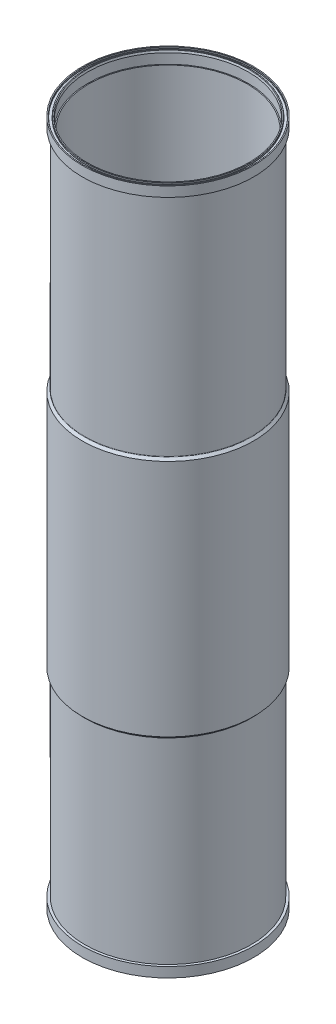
ISO-10303-21;
HEADER;
FILE_DESCRIPTION(('STEP AP214'),'2;1');
FILE_NAME('part.step','',(''),(''),'','','');
FILE_SCHEMA(('AUTOMOTIVE_DESIGN { 1 0 10303 214 1 1 1 1 }'));
ENDSEC;
DATA;
#1=APPLICATION_CONTEXT('core data for automotive mechanical design processes');
#2=APPLICATION_PROTOCOL_DEFINITION('international standard','automotive_design',2000,#1);
#3=PRODUCT_CONTEXT('',#1,'mechanical');
#4=PRODUCT('Part','Part','',(#3));
#5=PRODUCT_RELATED_PRODUCT_CATEGORY('part','',(#4));
#6=PRODUCT_DEFINITION_FORMATION('','',#4);
#7=PRODUCT_DEFINITION_CONTEXT('part definition',#1,'design');
#8=PRODUCT_DEFINITION('design','',#6,#7);
#9=PRODUCT_DEFINITION_SHAPE('','',#8);
#10=(LENGTH_UNIT() NAMED_UNIT(*) SI_UNIT(.MILLI.,.METRE.));
#11=(NAMED_UNIT(*) PLANE_ANGLE_UNIT() SI_UNIT($,.RADIAN.));
#12=(NAMED_UNIT(*) SI_UNIT($,.STERADIAN.) SOLID_ANGLE_UNIT());
#13=UNCERTAINTY_MEASURE_WITH_UNIT(LENGTH_MEASURE(1.E-05),#10,'distance_accuracy_value','');
#14=(GEOMETRIC_REPRESENTATION_CONTEXT(3) GLOBAL_UNCERTAINTY_ASSIGNED_CONTEXT((#13)) GLOBAL_UNIT_ASSIGNED_CONTEXT((#10,
#11,#12)) REPRESENTATION_CONTEXT('',''));
#15=CARTESIAN_POINT('',(0.,0.,0.));
#16=DIRECTION('',(0.,0.,1.));
#17=DIRECTION('',(1.,0.,0.));
#18=AXIS2_PLACEMENT_3D('',#15,#16,#17);
#19=CARTESIAN_POINT('',(0.,880.11,0.));
#20=DIRECTION('',(0.,1.,0.));
#21=DIRECTION('',(0.,0.,1.));
#22=AXIS2_PLACEMENT_3D('',#19,#20,#21);
#23=CYLINDRICAL_SURFACE('',#22,106.4387);
#24=CARTESIAN_POINT('',(0.,863.6,0.));
#25=DIRECTION('',(0.,1.,0.));
#26=DIRECTION('',(0.,0.,1.));
#27=AXIS2_PLACEMENT_3D('',#24,#25,#26);
#28=CIRCLE('',#27,106.4387);
#29=CARTESIAN_POINT('',(0.,863.6,106.4387));
#30=VERTEX_POINT('',#29);
#31=EDGE_CURVE('E81',#30,#30,#28,.T.);
#32=ORIENTED_EDGE('',*,*,#31,.F.);
#33=EDGE_LOOP('',(#32));
#34=FACE_BOUND('',#33,.T.);
#35=CARTESIAN_POINT('',(0.,574.927582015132,0.));
#36=DIRECTION('',(0.,1.,0.));
#37=DIRECTION('',(0.,0.,1.));
#38=AXIS2_PLACEMENT_3D('',#35,#36,#37);
#39=CIRCLE('',#38,106.4387);
#40=CARTESIAN_POINT('',(0.,574.927582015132,106.4387));
#41=VERTEX_POINT('',#40);
#42=EDGE_CURVE('E10',#41,#41,#39,.F.);
#43=ORIENTED_EDGE('',*,*,#42,.F.);
#44=EDGE_LOOP('',(#43));
#45=FACE_BOUND('',#44,.T.);
#46=ADVANCED_FACE('F34',(#34,#45),#23,.T.);
#47=CARTESIAN_POINT('',(-109.537499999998,0.,0.));
#48=DIRECTION('',(0.,1.,0.));
#49=DIRECTION('',(0.,0.,1.));
#50=AXIS2_PLACEMENT_3D('',#47,#48,#49);
#51=PLANE('',#50);
#52=CARTESIAN_POINT('',(0.,0.,0.));
#53=DIRECTION('',(0.,-1.,0.));
#54=DIRECTION('',(0.,0.,-1.));
#55=AXIS2_PLACEMENT_3D('',#52,#53,#54);
#56=CIRCLE('',#55,103.309290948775);
#57=CARTESIAN_POINT('',(0.,0.,-103.309290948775));
#58=VERTEX_POINT('',#57);
#59=EDGE_CURVE('E41',#58,#58,#56,.T.);
#60=ORIENTED_EDGE('',*,*,#59,.F.);
#61=EDGE_LOOP('',(#60));
#62=FACE_BOUND('',#61,.T.);
#63=CARTESIAN_POINT('',(0.,-3.33066907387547E-13,0.));
#64=DIRECTION('',(0.,-1.,0.));
#65=DIRECTION('',(0.,0.,-1.));
#66=AXIS2_PLACEMENT_3D('',#63,#64,#65);
#67=CIRCLE('',#66,104.4829);
#68=CARTESIAN_POINT('',(0.,-3.33066907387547E-13,-104.4829));
#69=VERTEX_POINT('',#68);
#70=EDGE_CURVE('E111',#69,#69,#67,.T.);
#71=ORIENTED_EDGE('',*,*,#70,.T.);
#72=EDGE_LOOP('',(#71));
#73=FACE_BOUND('',#72,.T.);
#74=ADVANCED_FACE('F189',(#62,#73),#51,.F.);
#75=CARTESIAN_POINT('',(-109.537499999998,876.3,0.));
#76=DIRECTION('',(0.,-1.,0.));
#77=DIRECTION('',(0.,0.,-1.));
#78=AXIS2_PLACEMENT_3D('',#75,#76,#77);
#79=PLANE('',#78);
#80=CARTESIAN_POINT('',(0.,876.3,0.));
#81=DIRECTION('',(0.,-1.,0.));
#82=DIRECTION('',(0.,0.,-1.));
#83=AXIS2_PLACEMENT_3D('',#80,#81,#82);
#84=CIRCLE('',#83,103.309290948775);
#85=CARTESIAN_POINT('',(0.,876.3,-103.309290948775));
#86=VERTEX_POINT('',#85);
#87=EDGE_CURVE('E54',#86,#86,#84,.T.);
#88=ORIENTED_EDGE('',*,*,#87,.T.);
#89=EDGE_LOOP('',(#88));
#90=FACE_BOUND('',#89,.T.);
#91=CARTESIAN_POINT('',(0.,876.3,0.));
#92=DIRECTION('',(0.,-1.,0.));
#93=DIRECTION('',(0.,0.,-1.));
#94=AXIS2_PLACEMENT_3D('',#91,#92,#93);
#95=CIRCLE('',#94,104.4829);
#96=CARTESIAN_POINT('',(0.,876.3,-104.4829));
#97=VERTEX_POINT('',#96);
#98=EDGE_CURVE('E87',#97,#97,#95,.T.);
#99=ORIENTED_EDGE('',*,*,#98,.F.);
#100=EDGE_LOOP('',(#99));
#101=FACE_BOUND('',#100,.T.);
#102=ADVANCED_FACE('F195',(#90,#101),#79,.F.);
#103=CARTESIAN_POINT('',(0.,0.,0.));
#104=DIRECTION('',(0.,-1.,0.));
#105=DIRECTION('',(0.,0.,-1.));
#106=AXIS2_PLACEMENT_3D('',#103,#104,#105);
#107=CYLINDRICAL_SURFACE('',#106,109.537499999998);
#108=CARTESIAN_POINT('',(0.,12.7,0.));
#109=DIRECTION('',(0.,1.,0.));
#110=DIRECTION('',(0.,0.,1.));
#111=AXIS2_PLACEMENT_3D('',#108,#109,#110);
#112=CIRCLE('',#111,109.537499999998);
#113=CARTESIAN_POINT('',(0.,12.7,109.537499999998));
#114=VERTEX_POINT('',#113);
#115=EDGE_CURVE('E75',#114,#114,#112,.T.);
#116=ORIENTED_EDGE('',*,*,#115,.F.);
#117=EDGE_LOOP('',(#116));
#118=FACE_BOUND('',#117,.T.);
#119=CARTESIAN_POINT('',(0.,0.,0.));
#120=DIRECTION('',(0.,-1.,0.));
#121=DIRECTION('',(0.,0.,-1.));
#122=AXIS2_PLACEMENT_3D('',#119,#120,#121);
#123=CIRCLE('',#122,109.537499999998);
#124=CARTESIAN_POINT('',(0.,0.,-109.537499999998));
#125=VERTEX_POINT('',#124);
#126=EDGE_CURVE('E45',#125,#125,#123,.T.);
#127=ORIENTED_EDGE('',*,*,#126,.F.);
#128=EDGE_LOOP('',(#127));
#129=FACE_BOUND('',#128,.T.);
#130=ADVANCED_FACE('F248',(#118,#129),#107,.T.);
#131=CARTESIAN_POINT('',(0.,0.,0.));
#132=DIRECTION('',(0.,-1.,0.));
#133=DIRECTION('',(0.,0.,-1.));
#134=AXIS2_PLACEMENT_3D('',#131,#132,#133);
#135=CONICAL_SURFACE('',#134,103.309290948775,0.26179938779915);
#136=CARTESIAN_POINT('',(0.,2.54,0.));
#137=DIRECTION('',(0.,-1.,0.));
#138=DIRECTION('',(0.,0.,-1.));
#139=AXIS2_PLACEMENT_3D('',#136,#137,#138);
#140=CIRCLE('',#139,102.6287);
#141=CARTESIAN_POINT('',(0.,2.54,-102.6287));
#142=VERTEX_POINT('',#141);
#143=EDGE_CURVE('E72',#142,#142,#140,.T.);
#144=ORIENTED_EDGE('',*,*,#143,.F.);
#145=EDGE_LOOP('',(#144));
#146=FACE_BOUND('',#145,.T.);
#147=ORIENTED_EDGE('',*,*,#59,.T.);
#148=EDGE_LOOP('',(#147));
#149=FACE_BOUND('',#148,.T.);
#150=ADVANCED_FACE('F36',(#146,#149),#135,.F.);
#151=CARTESIAN_POINT('',(0.,-3.33066907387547E-13,0.));
#152=DIRECTION('',(0.,-1.,0.));
#153=DIRECTION('',(0.,0.,-1.));
#154=AXIS2_PLACEMENT_3D('',#151,#152,#153);
#155=CIRCLE('',#154,108.2675);
#156=CARTESIAN_POINT('',(0.,-3.33066907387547E-13,-108.2675));
#157=VERTEX_POINT('',#156);
#158=EDGE_CURVE('E114',#157,#157,#155,.T.);
#159=ORIENTED_EDGE('',*,*,#158,.F.);
#160=EDGE_LOOP('',(#159));
#161=FACE_BOUND('',#160,.T.);
#162=ORIENTED_EDGE('',*,*,#126,.T.);
#163=EDGE_LOOP('',(#162));
#164=FACE_BOUND('',#163,.T.);
#165=ADVANCED_FACE('F197',(#161,#164),#51,.F.);
#166=CARTESIAN_POINT('',(0.,863.6,0.));
#167=DIRECTION('',(0.,1.,0.));
#168=DIRECTION('',(0.,0.,1.));
#169=AXIS2_PLACEMENT_3D('',#166,#167,#168);
#170=CIRCLE('',#169,109.537499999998);
#171=CARTESIAN_POINT('',(0.,863.6,109.537499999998));
#172=VERTEX_POINT('',#171);
#173=EDGE_CURVE('E84',#172,#172,#170,.T.);
#174=ORIENTED_EDGE('',*,*,#173,.T.);
#175=EDGE_LOOP('',(#174));
#176=FACE_BOUND('',#175,.T.);
#177=CARTESIAN_POINT('',(0.,876.3,0.));
#178=DIRECTION('',(0.,-1.,0.));
#179=DIRECTION('',(0.,0.,-1.));
#180=AXIS2_PLACEMENT_3D('',#177,#178,#179);
#181=CIRCLE('',#180,109.537499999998);
#182=CARTESIAN_POINT('',(0.,876.3,-109.537499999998));
#183=VERTEX_POINT('',#182);
#184=EDGE_CURVE('E49',#183,#183,#181,.T.);
#185=ORIENTED_EDGE('',*,*,#184,.T.);
#186=EDGE_LOOP('',(#185));
#187=FACE_BOUND('',#186,.T.);
#188=ADVANCED_FACE('F244',(#176,#187),#107,.T.);
#189=CARTESIAN_POINT('',(0.,876.3,0.));
#190=DIRECTION('',(0.,-1.,0.));
#191=DIRECTION('',(0.,0.,-1.));
#192=AXIS2_PLACEMENT_3D('',#189,#190,#191);
#193=CIRCLE('',#192,108.2675);
#194=CARTESIAN_POINT('',(0.,876.3,-108.2675));
#195=VERTEX_POINT('',#194);
#196=EDGE_CURVE('E90',#195,#195,#193,.T.);
#197=ORIENTED_EDGE('',*,*,#196,.T.);
#198=EDGE_LOOP('',(#197));
#199=FACE_BOUND('',#198,.T.);
#200=ORIENTED_EDGE('',*,*,#184,.F.);
#201=EDGE_LOOP('',(#200));
#202=FACE_BOUND('',#201,.T.);
#203=ADVANCED_FACE('F240',(#199,#202),#79,.F.);
#204=CARTESIAN_POINT('',(0.,873.76,0.));
#205=DIRECTION('',(0.,1.,0.));
#206=DIRECTION('',(0.,0.,1.));
#207=AXIS2_PLACEMENT_3D('',#204,#205,#206);
#208=CONICAL_SURFACE('',#207,102.6287,0.261799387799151);
#209=ORIENTED_EDGE('',*,*,#87,.F.);
#210=EDGE_LOOP('',(#209));
#211=FACE_BOUND('',#210,.T.);
#212=CARTESIAN_POINT('',(0.,873.76,0.));
#213=DIRECTION('',(0.,-1.,0.));
#214=DIRECTION('',(0.,0.,-1.));
#215=AXIS2_PLACEMENT_3D('',#212,#213,#214);
#216=CIRCLE('',#215,102.6287);
#217=CARTESIAN_POINT('',(0.,873.76,-102.6287));
#218=VERTEX_POINT('',#217);
#219=EDGE_CURVE('E57',#218,#218,#216,.T.);
#220=ORIENTED_EDGE('',*,*,#219,.T.);
#221=EDGE_LOOP('',(#220));
#222=FACE_BOUND('',#221,.T.);
#223=ADVANCED_FACE('F236',(#211,#222),#208,.F.);
#224=CARTESIAN_POINT('',(0.,0.,0.));
#225=DIRECTION('',(0.,-1.,0.));
#226=DIRECTION('',(0.,0.,-1.));
#227=AXIS2_PLACEMENT_3D('',#224,#225,#226);
#228=CYLINDRICAL_SURFACE('',#227,102.6287);
#229=ORIENTED_EDGE('',*,*,#219,.F.);
#230=EDGE_LOOP('',(#229));
#231=FACE_BOUND('',#230,.T.);
#232=CARTESIAN_POINT('',(0.,861.06,0.));
#233=DIRECTION('',(0.,-1.,0.));
#234=DIRECTION('',(0.,0.,-1.));
#235=AXIS2_PLACEMENT_3D('',#232,#233,#234);
#236=CIRCLE('',#235,102.6287);
#237=CARTESIAN_POINT('',(0.,861.06,-102.6287));
#238=VERTEX_POINT('',#237);
#239=EDGE_CURVE('E60',#238,#238,#236,.T.);
#240=ORIENTED_EDGE('',*,*,#239,.T.);
#241=EDGE_LOOP('',(#240));
#242=FACE_BOUND('',#241,.T.);
#243=ADVANCED_FACE('F232',(#231,#242),#228,.F.);
#244=CARTESIAN_POINT('',(-102.6287,861.06,0.));
#245=DIRECTION('',(0.,-1.,0.));
#246=DIRECTION('',(0.,0.,-1.));
#247=AXIS2_PLACEMENT_3D('',#244,#245,#246);
#248=PLANE('',#247);
#249=ORIENTED_EDGE('',*,*,#239,.F.);
#250=EDGE_LOOP('',(#249));
#251=FACE_BOUND('',#250,.T.);
#252=CARTESIAN_POINT('',(0.,861.06,0.));
#253=DIRECTION('',(0.,-1.,0.));
#254=DIRECTION('',(0.,0.,-1.));
#255=AXIS2_PLACEMENT_3D('',#252,#253,#254);
#256=CIRCLE('',#255,101.3587);
#257=CARTESIAN_POINT('',(0.,861.06,-101.3587));
#258=VERTEX_POINT('',#257);
#259=EDGE_CURVE('E63',#258,#258,#256,.T.);
#260=ORIENTED_EDGE('',*,*,#259,.T.);
#261=EDGE_LOOP('',(#260));
#262=FACE_BOUND('',#261,.T.);
#263=ADVANCED_FACE('F228',(#251,#262),#248,.F.);
#264=CARTESIAN_POINT('',(0.,0.,0.));
#265=DIRECTION('',(0.,-1.,0.));
#266=DIRECTION('',(0.,0.,-1.));
#267=AXIS2_PLACEMENT_3D('',#264,#265,#266);
#268=CYLINDRICAL_SURFACE('',#267,101.3587);
#269=ORIENTED_EDGE('',*,*,#259,.F.);
#270=EDGE_LOOP('',(#269));
#271=FACE_BOUND('',#270,.T.);
#272=CARTESIAN_POINT('',(0.,15.24,0.));
#273=DIRECTION('',(0.,-1.,0.));
#274=DIRECTION('',(0.,0.,-1.));
#275=AXIS2_PLACEMENT_3D('',#272,#273,#274);
#276=CIRCLE('',#275,101.3587);
#277=CARTESIAN_POINT('',(0.,15.24,-101.3587));
#278=VERTEX_POINT('',#277);
#279=EDGE_CURVE('E66',#278,#278,#276,.T.);
#280=ORIENTED_EDGE('',*,*,#279,.T.);
#281=EDGE_LOOP('',(#280));
#282=FACE_BOUND('',#281,.T.);
#283=ADVANCED_FACE('F224',(#271,#282),#268,.F.);
#284=CARTESIAN_POINT('',(-102.6287,15.24,0.));
#285=DIRECTION('',(0.,1.,0.));
#286=DIRECTION('',(0.,0.,1.));
#287=AXIS2_PLACEMENT_3D('',#284,#285,#286);
#288=PLANE('',#287);
#289=ORIENTED_EDGE('',*,*,#279,.F.);
#290=EDGE_LOOP('',(#289));
#291=FACE_BOUND('',#290,.T.);
#292=CARTESIAN_POINT('',(0.,15.24,0.));
#293=DIRECTION('',(0.,-1.,0.));
#294=DIRECTION('',(0.,0.,-1.));
#295=AXIS2_PLACEMENT_3D('',#292,#293,#294);
#296=CIRCLE('',#295,102.6287);
#297=CARTESIAN_POINT('',(0.,15.24,-102.6287));
#298=VERTEX_POINT('',#297);
#299=EDGE_CURVE('E69',#298,#298,#296,.T.);
#300=ORIENTED_EDGE('',*,*,#299,.T.);
#301=EDGE_LOOP('',(#300));
#302=FACE_BOUND('',#301,.T.);
#303=ADVANCED_FACE('F216',(#291,#302),#288,.F.);
#304=CARTESIAN_POINT('',(0.,0.,0.));
#305=DIRECTION('',(0.,-1.,0.));
#306=DIRECTION('',(0.,0.,-1.));
#307=AXIS2_PLACEMENT_3D('',#304,#305,#306);
#308=CYLINDRICAL_SURFACE('',#307,102.6287);
#309=ORIENTED_EDGE('',*,*,#299,.F.);
#310=EDGE_LOOP('',(#309));
#311=FACE_BOUND('',#310,.T.);
#312=ORIENTED_EDGE('',*,*,#143,.T.);
#313=EDGE_LOOP('',(#312));
#314=FACE_BOUND('',#313,.T.);
#315=ADVANCED_FACE('F211',(#311,#314),#308,.F.);
#316=CARTESIAN_POINT('',(-109.537499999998,12.7,0.));
#317=DIRECTION('',(0.,-1.,0.));
#318=DIRECTION('',(0.,0.,-1.));
#319=AXIS2_PLACEMENT_3D('',#316,#317,#318);
#320=PLANE('',#319);
#321=CARTESIAN_POINT('',(0.,12.7,0.));
#322=DIRECTION('',(0.,1.,0.));
#323=DIRECTION('',(0.,0.,1.));
#324=AXIS2_PLACEMENT_3D('',#321,#322,#323);
#325=CIRCLE('',#324,106.4387);
#326=CARTESIAN_POINT('',(0.,12.7,106.4387));
#327=VERTEX_POINT('',#326);
#328=EDGE_CURVE('E78',#327,#327,#325,.T.);
#329=ORIENTED_EDGE('',*,*,#328,.F.);
#330=EDGE_LOOP('',(#329));
#331=FACE_BOUND('',#330,.T.);
#332=ORIENTED_EDGE('',*,*,#115,.T.);
#333=EDGE_LOOP('',(#332));
#334=FACE_BOUND('',#333,.T.);
#335=ADVANCED_FACE('F204',(#331,#334),#320,.F.);
#336=CARTESIAN_POINT('',(0.,263.272417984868,0.));
#337=DIRECTION('',(0.,-1.,0.));
#338=DIRECTION('',(0.,0.,-1.));
#339=AXIS2_PLACEMENT_3D('',#336,#337,#338);
#340=CIRCLE('',#339,106.4387);
#341=CARTESIAN_POINT('',(0.,263.272417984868,-106.4387));
#342=VERTEX_POINT('',#341);
#343=EDGE_CURVE('E147',#342,#342,#340,.T.);
#344=ORIENTED_EDGE('',*,*,#343,.T.);
#345=EDGE_LOOP('',(#344));
#346=FACE_BOUND('',#345,.T.);
#347=ORIENTED_EDGE('',*,*,#328,.T.);
#348=EDGE_LOOP('',(#347));
#349=FACE_BOUND('',#348,.T.);
#350=ADVANCED_FACE('F151',(#346,#349),#23,.T.);
#351=CARTESIAN_POINT('',(-109.537499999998,863.6,0.));
#352=DIRECTION('',(0.,1.,0.));
#353=DIRECTION('',(0.,0.,1.));
#354=AXIS2_PLACEMENT_3D('',#351,#352,#353);
#355=PLANE('',#354);
#356=ORIENTED_EDGE('',*,*,#173,.F.);
#357=EDGE_LOOP('',(#356));
#358=FACE_BOUND('',#357,.T.);
#359=ORIENTED_EDGE('',*,*,#31,.T.);
#360=EDGE_LOOP('',(#359));
#361=FACE_BOUND('',#360,.T.);
#362=ADVANCED_FACE('F203',(#358,#361),#355,.F.);
#363=CARTESIAN_POINT('',(0.,876.173,0.));
#364=DIRECTION('',(0.,-1.,0.));
#365=DIRECTION('',(0.,0.,-1.));
#366=AXIS2_PLACEMENT_3D('',#363,#364,#365);
#367=TOROIDAL_SURFACE('',#366,104.4829,0.127000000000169);
#368=ORIENTED_EDGE('',*,*,#98,.T.);
#369=EDGE_LOOP('',(#368));
#370=FACE_BOUND('',#369,.T.);
#371=CARTESIAN_POINT('',(0.,876.173,0.));
#372=DIRECTION('',(0.,-1.,0.));
#373=DIRECTION('',(0.,0.,-1.));
#374=AXIS2_PLACEMENT_3D('',#371,#372,#373);
#375=CIRCLE('',#374,104.6099);
#376=CARTESIAN_POINT('',(0.,876.173,-104.6099));
#377=VERTEX_POINT('',#376);
#378=EDGE_CURVE('E108',#377,#377,#375,.T.);
#379=ORIENTED_EDGE('',*,*,#378,.F.);
#380=EDGE_LOOP('',(#379));
#381=FACE_BOUND('',#380,.T.);
#382=ADVANCED_FACE('F209',(#370,#381),#367,.T.);
#383=CARTESIAN_POINT('',(0.,876.173,0.));
#384=DIRECTION('',(0.,-1.,0.));
#385=DIRECTION('',(0.,0.,-1.));
#386=AXIS2_PLACEMENT_3D('',#383,#384,#385);
#387=TOROIDAL_SURFACE('',#386,108.2675,0.127000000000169);
#388=CARTESIAN_POINT('',(0.,876.173,0.));
#389=DIRECTION('',(0.,-1.,0.));
#390=DIRECTION('',(0.,0.,-1.));
#391=AXIS2_PLACEMENT_3D('',#388,#389,#390);
#392=CIRCLE('',#391,108.1405);
#393=CARTESIAN_POINT('',(0.,876.173,-108.1405));
#394=VERTEX_POINT('',#393);
#395=EDGE_CURVE('E93',#394,#394,#392,.T.);
#396=ORIENTED_EDGE('',*,*,#395,.T.);
#397=EDGE_LOOP('',(#396));
#398=FACE_BOUND('',#397,.T.);
#399=ORIENTED_EDGE('',*,*,#196,.F.);
#400=EDGE_LOOP('',(#399));
#401=FACE_BOUND('',#400,.T.);
#402=ADVANCED_FACE('F274',(#398,#401),#387,.T.);
#403=CARTESIAN_POINT('',(0.,0.,0.));
#404=DIRECTION('',(0.,-1.,0.));
#405=DIRECTION('',(0.,0.,-1.));
#406=AXIS2_PLACEMENT_3D('',#403,#404,#405);
#407=CYLINDRICAL_SURFACE('',#406,108.1405);
#408=CARTESIAN_POINT('',(0.,874.5982,0.));
#409=DIRECTION('',(0.,-1.,0.));
#410=DIRECTION('',(0.,0.,-1.));
#411=AXIS2_PLACEMENT_3D('',#408,#409,#410);
#412=CIRCLE('',#411,108.1405);
#413=CARTESIAN_POINT('',(0.,874.5982,-108.1405));
#414=VERTEX_POINT('',#413);
#415=EDGE_CURVE('E96',#414,#414,#412,.T.);
#416=ORIENTED_EDGE('',*,*,#415,.T.);
#417=EDGE_LOOP('',(#416));
#418=FACE_BOUND('',#417,.T.);
#419=ORIENTED_EDGE('',*,*,#395,.F.);
#420=EDGE_LOOP('',(#419));
#421=FACE_BOUND('',#420,.T.);
#422=ADVANCED_FACE('F300',(#418,#421),#407,.F.);
#423=CARTESIAN_POINT('',(0.,874.5982,0.));
#424=DIRECTION('',(0.,-1.,0.));
#425=DIRECTION('',(0.,0.,-1.));
#426=AXIS2_PLACEMENT_3D('',#423,#424,#425);
#427=TOROIDAL_SURFACE('',#426,107.8865,0.25399999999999);
#428=CARTESIAN_POINT('',(0.,874.3442,0.));
#429=DIRECTION('',(0.,-1.,0.));
#430=DIRECTION('',(0.,0.,-1.));
#431=AXIS2_PLACEMENT_3D('',#428,#429,#430);
#432=CIRCLE('',#431,107.8865);
#433=CARTESIAN_POINT('',(0.,874.3442,-107.8865));
#434=VERTEX_POINT('',#433);
#435=EDGE_CURVE('E99',#434,#434,#432,.T.);
#436=ORIENTED_EDGE('',*,*,#435,.T.);
#437=EDGE_LOOP('',(#436));
#438=FACE_BOUND('',#437,.T.);
#439=ORIENTED_EDGE('',*,*,#415,.F.);
#440=EDGE_LOOP('',(#439));
#441=FACE_BOUND('',#440,.T.);
#442=ADVANCED_FACE('F294',(#438,#441),#427,.F.);
#443=CARTESIAN_POINT('',(-104.8639,874.3442,0.));
#444=DIRECTION('',(0.,1.,0.));
#445=DIRECTION('',(0.,0.,1.));
#446=AXIS2_PLACEMENT_3D('',#443,#444,#445);
#447=PLANE('',#446);
#448=CARTESIAN_POINT('',(0.,874.3442,0.));
#449=DIRECTION('',(0.,-1.,0.));
#450=DIRECTION('',(0.,0.,-1.));
#451=AXIS2_PLACEMENT_3D('',#448,#449,#450);
#452=CIRCLE('',#451,104.8639);
#453=CARTESIAN_POINT('',(0.,874.3442,-104.8639));
#454=VERTEX_POINT('',#453);
#455=EDGE_CURVE('E102',#454,#454,#452,.T.);
#456=ORIENTED_EDGE('',*,*,#455,.T.);
#457=EDGE_LOOP('',(#456));
#458=FACE_BOUND('',#457,.T.);
#459=ORIENTED_EDGE('',*,*,#435,.F.);
#460=EDGE_LOOP('',(#459));
#461=FACE_BOUND('',#460,.T.);
#462=ADVANCED_FACE('F288',(#458,#461),#447,.T.);
#463=CARTESIAN_POINT('',(0.,874.5982,0.));
#464=DIRECTION('',(0.,-1.,0.));
#465=DIRECTION('',(0.,0.,-1.));
#466=AXIS2_PLACEMENT_3D('',#463,#464,#465);
#467=TOROIDAL_SURFACE('',#466,104.8639,0.25399999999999);
#468=CARTESIAN_POINT('',(0.,874.5982,0.));
#469=DIRECTION('',(0.,-1.,0.));
#470=DIRECTION('',(0.,0.,-1.));
#471=AXIS2_PLACEMENT_3D('',#468,#469,#470);
#472=CIRCLE('',#471,104.6099);
#473=CARTESIAN_POINT('',(0.,874.5982,-104.6099));
#474=VERTEX_POINT('',#473);
#475=EDGE_CURVE('E105',#474,#474,#472,.T.);
#476=ORIENTED_EDGE('',*,*,#475,.T.);
#477=EDGE_LOOP('',(#476));
#478=FACE_BOUND('',#477,.T.);
#479=ORIENTED_EDGE('',*,*,#455,.F.);
#480=EDGE_LOOP('',(#479));
#481=FACE_BOUND('',#480,.T.);
#482=ADVANCED_FACE('F282',(#478,#481),#467,.F.);
#483=CARTESIAN_POINT('',(0.,0.,0.));
#484=DIRECTION('',(0.,-1.,0.));
#485=DIRECTION('',(0.,0.,-1.));
#486=AXIS2_PLACEMENT_3D('',#483,#484,#485);
#487=CYLINDRICAL_SURFACE('',#486,104.6099);
#488=ORIENTED_EDGE('',*,*,#378,.T.);
#489=EDGE_LOOP('',(#488));
#490=FACE_BOUND('',#489,.T.);
#491=ORIENTED_EDGE('',*,*,#475,.F.);
#492=EDGE_LOOP('',(#491));
#493=FACE_BOUND('',#492,.T.);
#494=ADVANCED_FACE('F278',(#490,#493),#487,.T.);
#495=CARTESIAN_POINT('',(0.,0.126999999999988,0.));
#496=DIRECTION('',(0.,1.,0.));
#497=DIRECTION('',(0.,0.,-1.));
#498=AXIS2_PLACEMENT_3D('',#495,#496,#497);
#499=TOROIDAL_SURFACE('',#498,104.4829,0.127000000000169);
#500=ORIENTED_EDGE('',*,*,#70,.F.);
#501=EDGE_LOOP('',(#500));
#502=FACE_BOUND('',#501,.T.);
#503=CARTESIAN_POINT('',(0.,0.126999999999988,0.));
#504=DIRECTION('',(0.,-1.,0.));
#505=DIRECTION('',(0.,0.,-1.));
#506=AXIS2_PLACEMENT_3D('',#503,#504,#505);
#507=CIRCLE('',#506,104.6099);
#508=CARTESIAN_POINT('',(0.,0.126999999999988,-104.6099));
#509=VERTEX_POINT('',#508);
#510=EDGE_CURVE('E132',#509,#509,#507,.T.);
#511=ORIENTED_EDGE('',*,*,#510,.T.);
#512=EDGE_LOOP('',(#511));
#513=FACE_BOUND('',#512,.T.);
#514=ADVANCED_FACE('F281',(#502,#513),#499,.T.);
#515=CARTESIAN_POINT('',(0.,0.126999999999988,0.));
#516=DIRECTION('',(0.,1.,0.));
#517=DIRECTION('',(0.,0.,-1.));
#518=AXIS2_PLACEMENT_3D('',#515,#516,#517);
#519=TOROIDAL_SURFACE('',#518,108.2675,0.127000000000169);
#520=CARTESIAN_POINT('',(0.,0.126999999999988,0.));
#521=DIRECTION('',(0.,-1.,0.));
#522=DIRECTION('',(0.,0.,-1.));
#523=AXIS2_PLACEMENT_3D('',#520,#521,#522);
#524=CIRCLE('',#523,108.1405);
#525=CARTESIAN_POINT('',(0.,0.126999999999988,-108.1405));
#526=VERTEX_POINT('',#525);
#527=EDGE_CURVE('E117',#526,#526,#524,.T.);
#528=ORIENTED_EDGE('',*,*,#527,.F.);
#529=EDGE_LOOP('',(#528));
#530=FACE_BOUND('',#529,.T.);
#531=ORIENTED_EDGE('',*,*,#158,.T.);
#532=EDGE_LOOP('',(#531));
#533=FACE_BOUND('',#532,.T.);
#534=ADVANCED_FACE('F321',(#530,#533),#519,.T.);
#535=CARTESIAN_POINT('',(0.,876.3,0.));
#536=DIRECTION('',(0.,1.,0.));
#537=DIRECTION('',(0.,0.,-1.));
#538=AXIS2_PLACEMENT_3D('',#535,#536,#537);
#539=CYLINDRICAL_SURFACE('',#538,108.1405);
#540=CARTESIAN_POINT('',(0.,1.70179999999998,0.));
#541=DIRECTION('',(0.,-1.,0.));
#542=DIRECTION('',(0.,0.,-1.));
#543=AXIS2_PLACEMENT_3D('',#540,#541,#542);
#544=CIRCLE('',#543,108.1405);
#545=CARTESIAN_POINT('',(0.,1.70179999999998,-108.1405));
#546=VERTEX_POINT('',#545);
#547=EDGE_CURVE('E120',#546,#546,#544,.T.);
#548=ORIENTED_EDGE('',*,*,#547,.F.);
#549=EDGE_LOOP('',(#548));
#550=FACE_BOUND('',#549,.T.);
#551=ORIENTED_EDGE('',*,*,#527,.T.);
#552=EDGE_LOOP('',(#551));
#553=FACE_BOUND('',#552,.T.);
#554=ADVANCED_FACE('F325',(#550,#553),#539,.F.);
#555=CARTESIAN_POINT('',(0.,1.70179999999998,0.));
#556=DIRECTION('',(0.,1.,0.));
#557=DIRECTION('',(0.,0.,-1.));
#558=AXIS2_PLACEMENT_3D('',#555,#556,#557);
#559=TOROIDAL_SURFACE('',#558,107.8865,0.25399999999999);
#560=CARTESIAN_POINT('',(0.,1.95579999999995,0.));
#561=DIRECTION('',(0.,-1.,0.));
#562=DIRECTION('',(0.,0.,-1.));
#563=AXIS2_PLACEMENT_3D('',#560,#561,#562);
#564=CIRCLE('',#563,107.8865);
#565=CARTESIAN_POINT('',(0.,1.95579999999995,-107.8865));
#566=VERTEX_POINT('',#565);
#567=EDGE_CURVE('E123',#566,#566,#564,.T.);
#568=ORIENTED_EDGE('',*,*,#567,.F.);
#569=EDGE_LOOP('',(#568));
#570=FACE_BOUND('',#569,.T.);
#571=ORIENTED_EDGE('',*,*,#547,.T.);
#572=EDGE_LOOP('',(#571));
#573=FACE_BOUND('',#572,.T.);
#574=ADVANCED_FACE('F329',(#570,#573),#559,.F.);
#575=CARTESIAN_POINT('',(-104.8639,1.95579999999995,0.));
#576=DIRECTION('',(0.,-1.,0.));
#577=DIRECTION('',(0.,0.,1.));
#578=AXIS2_PLACEMENT_3D('',#575,#576,#577);
#579=PLANE('',#578);
#580=CARTESIAN_POINT('',(0.,1.95579999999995,0.));
#581=DIRECTION('',(0.,-1.,0.));
#582=DIRECTION('',(0.,0.,-1.));
#583=AXIS2_PLACEMENT_3D('',#580,#581,#582);
#584=CIRCLE('',#583,104.8639);
#585=CARTESIAN_POINT('',(0.,1.95579999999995,-104.8639));
#586=VERTEX_POINT('',#585);
#587=EDGE_CURVE('E126',#586,#586,#584,.T.);
#588=ORIENTED_EDGE('',*,*,#587,.F.);
#589=EDGE_LOOP('',(#588));
#590=FACE_BOUND('',#589,.T.);
#591=ORIENTED_EDGE('',*,*,#567,.T.);
#592=EDGE_LOOP('',(#591));
#593=FACE_BOUND('',#592,.T.);
#594=ADVANCED_FACE('F333',(#590,#593),#579,.T.);
#595=CARTESIAN_POINT('',(0.,1.70179999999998,0.));
#596=DIRECTION('',(0.,1.,0.));
#597=DIRECTION('',(0.,0.,-1.));
#598=AXIS2_PLACEMENT_3D('',#595,#596,#597);
#599=TOROIDAL_SURFACE('',#598,104.8639,0.25399999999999);
#600=CARTESIAN_POINT('',(0.,1.70179999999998,0.));
#601=DIRECTION('',(0.,-1.,0.));
#602=DIRECTION('',(0.,0.,-1.));
#603=AXIS2_PLACEMENT_3D('',#600,#601,#602);
#604=CIRCLE('',#603,104.6099);
#605=CARTESIAN_POINT('',(0.,1.70179999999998,-104.6099));
#606=VERTEX_POINT('',#605);
#607=EDGE_CURVE('E129',#606,#606,#604,.T.);
#608=ORIENTED_EDGE('',*,*,#607,.F.);
#609=EDGE_LOOP('',(#608));
#610=FACE_BOUND('',#609,.T.);
#611=ORIENTED_EDGE('',*,*,#587,.T.);
#612=EDGE_LOOP('',(#611));
#613=FACE_BOUND('',#612,.T.);
#614=ADVANCED_FACE('F185',(#610,#613),#599,.F.);
#615=CARTESIAN_POINT('',(0.,876.3,0.));
#616=DIRECTION('',(0.,1.,0.));
#617=DIRECTION('',(0.,0.,-1.));
#618=AXIS2_PLACEMENT_3D('',#615,#616,#617);
#619=CYLINDRICAL_SURFACE('',#618,104.6099);
#620=ORIENTED_EDGE('',*,*,#510,.F.);
#621=EDGE_LOOP('',(#620));
#622=FACE_BOUND('',#621,.T.);
#623=ORIENTED_EDGE('',*,*,#607,.T.);
#624=EDGE_LOOP('',(#623));
#625=FACE_BOUND('',#624,.T.);
#626=ADVANCED_FACE('F180',(#622,#625),#619,.T.);
#627=CARTESIAN_POINT('',(0.,574.927582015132,0.));
#628=DIRECTION('',(0.,-1.,0.));
#629=DIRECTION('',(0.,0.,-1.));
#630=AXIS2_PLACEMENT_3D('',#627,#628,#629);
#631=TOROIDAL_SURFACE('',#630,107.23245,0.793749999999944);
#632=CARTESIAN_POINT('',(0.,574.366316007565,0.));
#633=DIRECTION('',(0.,-1.,0.));
#634=DIRECTION('',(0.,0.,-1.));
#635=AXIS2_PLACEMENT_3D('',#632,#633,#634);
#636=CIRCLE('',#635,106.671183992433);
#637=CARTESIAN_POINT('',(0.,574.366316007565,-106.671183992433));
#638=VERTEX_POINT('',#637);
#639=EDGE_CURVE('E135',#638,#638,#636,.T.);
#640=ORIENTED_EDGE('',*,*,#639,.F.);
#641=EDGE_LOOP('',(#640));
#642=FACE_BOUND('',#641,.T.);
#643=ORIENTED_EDGE('',*,*,#42,.T.);
#644=EDGE_LOOP('',(#643));
#645=FACE_BOUND('',#644,.T.);
#646=ADVANCED_FACE('F175',(#642,#645),#631,.F.);
#647=CARTESIAN_POINT('',(0.,574.366316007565,0.));
#648=DIRECTION('',(0.,-1.,0.));
#649=DIRECTION('',(0.,0.,-1.));
#650=AXIS2_PLACEMENT_3D('',#647,#648,#649);
#651=CONICAL_SURFACE('',#650,106.671183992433,0.785398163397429);
#652=CARTESIAN_POINT('',(0.,571.5,0.));
#653=DIRECTION('',(0.,-1.,0.));
#654=DIRECTION('',(0.,0.,-1.));
#655=AXIS2_PLACEMENT_3D('',#652,#653,#654);
#656=CIRCLE('',#655,109.537499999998);
#657=CARTESIAN_POINT('',(0.,571.5,-109.537499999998));
#658=VERTEX_POINT('',#657);
#659=EDGE_CURVE('E138',#658,#658,#656,.T.);
#660=ORIENTED_EDGE('',*,*,#659,.F.);
#661=EDGE_LOOP('',(#660));
#662=FACE_BOUND('',#661,.T.);
#663=ORIENTED_EDGE('',*,*,#639,.T.);
#664=EDGE_LOOP('',(#663));
#665=FACE_BOUND('',#664,.T.);
#666=ADVANCED_FACE('F169',(#662,#665),#651,.T.);
#667=CARTESIAN_POINT('',(0.,0.,0.));
#668=DIRECTION('',(0.,-1.,0.));
#669=DIRECTION('',(0.,0.,-1.));
#670=AXIS2_PLACEMENT_3D('',#667,#668,#669);
#671=CYLINDRICAL_SURFACE('',#670,109.537499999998);
#672=CARTESIAN_POINT('',(0.,266.7,0.));
#673=DIRECTION('',(0.,-1.,0.));
#674=DIRECTION('',(0.,0.,-1.));
#675=AXIS2_PLACEMENT_3D('',#672,#673,#674);
#676=CIRCLE('',#675,109.537499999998);
#677=CARTESIAN_POINT('',(0.,266.7,-109.537499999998));
#678=VERTEX_POINT('',#677);
#679=EDGE_CURVE('E141',#678,#678,#676,.T.);
#680=ORIENTED_EDGE('',*,*,#679,.F.);
#681=EDGE_LOOP('',(#680));
#682=FACE_BOUND('',#681,.T.);
#683=ORIENTED_EDGE('',*,*,#659,.T.);
#684=EDGE_LOOP('',(#683));
#685=FACE_BOUND('',#684,.T.);
#686=ADVANCED_FACE('F163',(#682,#685),#671,.T.);
#687=CARTESIAN_POINT('',(0.,266.7,0.));
#688=DIRECTION('',(0.,1.,0.));
#689=DIRECTION('',(0.,0.,1.));
#690=AXIS2_PLACEMENT_3D('',#687,#688,#689);
#691=CONICAL_SURFACE('',#690,109.537499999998,0.785398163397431);
#692=CARTESIAN_POINT('',(0.,263.833683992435,0.));
#693=DIRECTION('',(0.,-1.,0.));
#694=DIRECTION('',(0.,0.,-1.));
#695=AXIS2_PLACEMENT_3D('',#692,#693,#694);
#696=CIRCLE('',#695,106.671183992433);
#697=CARTESIAN_POINT('',(0.,263.833683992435,-106.671183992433));
#698=VERTEX_POINT('',#697);
#699=EDGE_CURVE('E144',#698,#698,#696,.T.);
#700=ORIENTED_EDGE('',*,*,#699,.F.);
#701=EDGE_LOOP('',(#700));
#702=FACE_BOUND('',#701,.T.);
#703=ORIENTED_EDGE('',*,*,#679,.T.);
#704=EDGE_LOOP('',(#703));
#705=FACE_BOUND('',#704,.T.);
#706=ADVANCED_FACE('F157',(#702,#705),#691,.T.);
#707=CARTESIAN_POINT('',(0.,263.272417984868,0.));
#708=DIRECTION('',(0.,-1.,0.));
#709=DIRECTION('',(0.,0.,-1.));
#710=AXIS2_PLACEMENT_3D('',#707,#708,#709);
#711=TOROIDAL_SURFACE('',#710,107.23245,0.793749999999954);
#712=ORIENTED_EDGE('',*,*,#343,.F.);
#713=EDGE_LOOP('',(#712));
#714=FACE_BOUND('',#713,.T.);
#715=ORIENTED_EDGE('',*,*,#699,.T.);
#716=EDGE_LOOP('',(#715));
#717=FACE_BOUND('',#716,.T.);
#718=ADVANCED_FACE('F154',(#714,#717),#711,.F.);
#719=CLOSED_SHELL('',(#46,#74,#102,#130,#150,#165,#188,#203,#223,#243,#263,#283,#303,#315,#335,
#350,#362,#382,#402,#422,#442,#462,#482,#494,#514,#534,#554,#574,#594,#614,#626,#646,#666,#686,
#706,#718));
#720=MANIFOLD_SOLID_BREP('B2',#719);
#721=ADVANCED_BREP_SHAPE_REPRESENTATION('',(#18,#720),#14);
#722=SHAPE_DEFINITION_REPRESENTATION(#9,#721);
ENDSEC;
END-ISO-10303-21;
